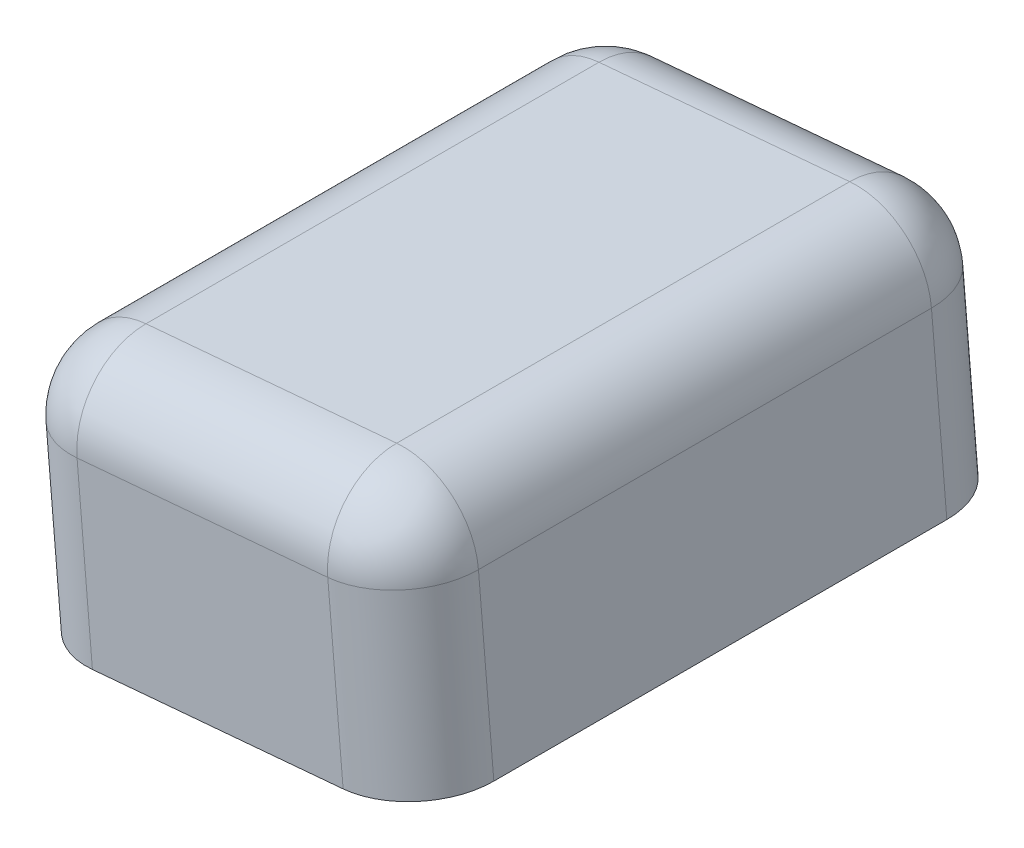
from build123d import *

# Parameters (mm, degrees)
ESQUISSE5_W      = 8
ESQUISSE5_H      = 12
EXTRUSION1_DEPTH = 5
CONG_1_R         = 1.5


with BuildPart() as part:
    # Esquisse5 → Extrusion1 (new body)
    with BuildSketch(Plane(origin=(0, 0, 0), x_dir=(-0.9961946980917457, -0.08715574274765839, 0), z_dir=(-0.08715574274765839, 0.9961946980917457, 0))):
        with Locations((4, 6)):
            Rectangle(ESQUISSE5_W, ESQUISSE5_H)
    extrude(amount=EXTRUSION1_DEPTH)

    # Cong_1
    cong_1_edges = [part.edges().sort_by_distance(p)[0] for p in [
        (-8.405336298, 4.283727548, 6),
        (-4.420557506, 4.632350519, 12),
        (-0.435778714, 4.98097349, 6),
        (-4.420557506, 4.632350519, 0),
        (-0.217889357, 2.490486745, 12),
        (-8.187446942, 1.793240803, 12),
        (-8.187446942, 1.793240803, 0),
        (-0.217889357, 2.490486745, 0),
    ]]
    fillet(cong_1_edges, radius=CONG_1_R)


solid = part.part
